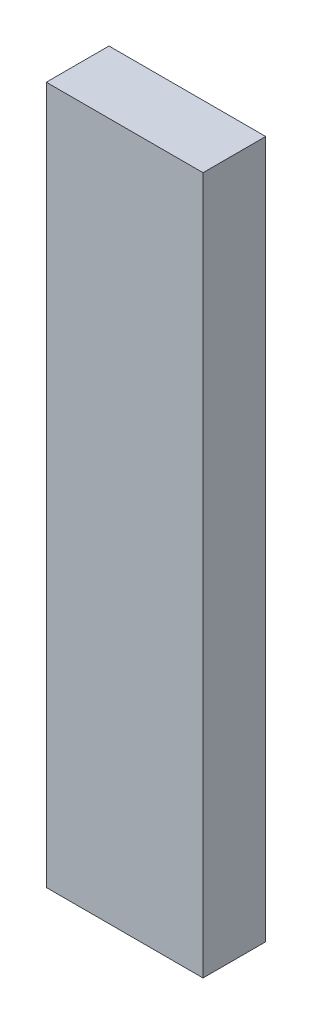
from build123d import *

# Parameters (mm, degrees)
ESQUISSE1_W      = 20
ESQUISSE1_H      = 89
EXTRUSION1_DEPTH = 8


with BuildPart() as part:
    # Esquisse1 → Extrusion1 (new body)
    with BuildSketch(Plane.XY):
        with Locations((10, 44.5)):
            Rectangle(ESQUISSE1_W, ESQUISSE1_H)
    extrude(amount=EXTRUSION1_DEPTH)


solid = part.part
